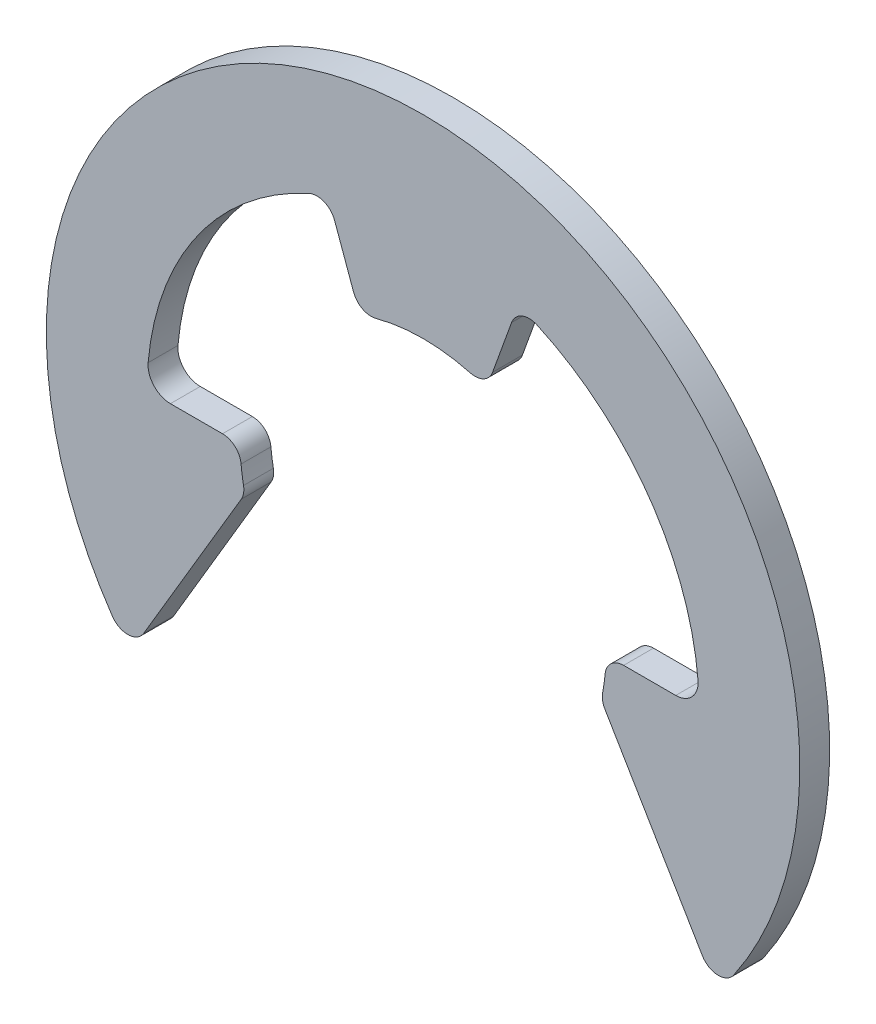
from build123d import *

# Parameters (mm, degrees)
EXTRUDE_1_DEPTH = 0.8
FILLET_1_R      = 0.5
FILLET_2_R      = 0.5
FILLET_3_R      = 0.6
FILLET_4_R      = 0.5


with BuildPart() as part:
    # Sketch 1 → Extrude 1 (new body)
    with BuildSketch(Plane.XY.offset(0.4)):
        with BuildLine():
            Line((4.774934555, -1.1), (7.868930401, -6.331661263))
            ThreePointArc((7.868930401, -6.331661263), (0, 10.1), (-7.868930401, -6.331661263))
            Line((-7.868930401, -6.331661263), (-4.774934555, -1.1))
            ThreePointArc((-4.774934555, -1.1), (-4.868633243, -0.553543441), (-4.9, 0))
            Line((-4.9, 0), (-7.4, 0))
            ThreePointArc((-7.4, 0), (-6.067536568, 4.236153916), (-2.55, 6.946761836))
            Line((-2.55, 6.946761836), (-1.7, 4.595650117))
            ThreePointArc((-1.7, 4.595650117), (0, 4.9), (1.7, 4.595650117))
            Line((1.7, 4.595650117), (2.55, 6.946761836))
            ThreePointArc((2.55, 6.946761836), (6.067536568, 4.236153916), (7.4, 0))
            Line((7.4, 0), (4.9, 0))
            ThreePointArc((4.9, 0), (4.868633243, -0.553543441), (4.774934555, -1.1))
        make_face()
    extrude(amount=-EXTRUDE_1_DEPTH)

    # Fillet 1
    fillet_1_edges = [part.edges().sort_by_distance(p)[0] for p in [
        (2.55, 6.946761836, 0),
        (-2.55, 6.946761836, 0),
    ]]
    fillet(fillet_1_edges, radius=FILLET_1_R)

    # Fillet 2
    fillet_2_edges = [part.edges().sort_by_distance(p)[0] for p in [
        (1.7, 4.595650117, 0),
        (-1.7, 4.595650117, 0),
    ]]
    fillet(fillet_2_edges, radius=FILLET_2_R)

    # Fillet 3
    fillet_3_edges = [part.edges().sort_by_distance(p)[0] for p in [
        (7.4, 0, 0),
        (-7.4, 0, 0),
    ]]
    fillet(fillet_3_edges, radius=FILLET_3_R)

    # Fillet 4
    fillet_4_edges = [part.edges().sort_by_distance(p)[0] for p in [
        (4.9, 0, 0),
        (-4.9, 0, 0),
        (-4.774934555, -1.1, 0),
        (-7.868930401, -6.331661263, 0),
        (7.868930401, -6.331661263, 0),
        (4.774934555, -1.1, 0),
    ]]
    fillet(fillet_4_edges, radius=FILLET_4_R)


solid = part.part
